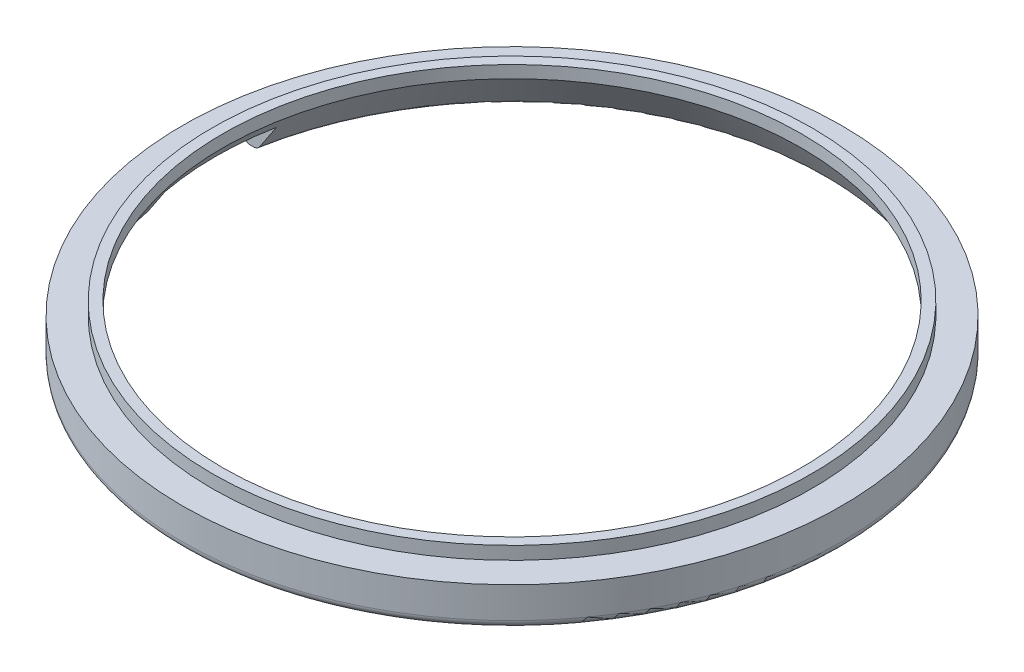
ISO-10303-21;
HEADER;
FILE_DESCRIPTION(('STEP AP214'),'2;1');
FILE_NAME('part.step','',(''),(''),'','','');
FILE_SCHEMA(('AUTOMOTIVE_DESIGN { 1 0 10303 214 1 1 1 1 }'));
ENDSEC;
DATA;
#1=APPLICATION_CONTEXT('core data for automotive mechanical design processes');
#2=APPLICATION_PROTOCOL_DEFINITION('international standard','automotive_design',2000,#1);
#3=PRODUCT_CONTEXT('',#1,'mechanical');
#4=PRODUCT('Part','Part','',(#3));
#5=PRODUCT_RELATED_PRODUCT_CATEGORY('part','',(#4));
#6=PRODUCT_DEFINITION_FORMATION('','',#4);
#7=PRODUCT_DEFINITION_CONTEXT('part definition',#1,'design');
#8=PRODUCT_DEFINITION('design','',#6,#7);
#9=PRODUCT_DEFINITION_SHAPE('','',#8);
#10=(LENGTH_UNIT() NAMED_UNIT(*) SI_UNIT(.MILLI.,.METRE.));
#11=(NAMED_UNIT(*) PLANE_ANGLE_UNIT() SI_UNIT($,.RADIAN.));
#12=(NAMED_UNIT(*) SI_UNIT($,.STERADIAN.) SOLID_ANGLE_UNIT());
#13=UNCERTAINTY_MEASURE_WITH_UNIT(LENGTH_MEASURE(1.E-05),#10,'distance_accuracy_value','');
#14=(GEOMETRIC_REPRESENTATION_CONTEXT(3) GLOBAL_UNCERTAINTY_ASSIGNED_CONTEXT((#13)) GLOBAL_UNIT_ASSIGNED_CONTEXT((#10,
#11,#12)) REPRESENTATION_CONTEXT('',''));
#15=CARTESIAN_POINT('',(0.,0.,0.));
#16=DIRECTION('',(0.,0.,1.));
#17=DIRECTION('',(1.,0.,0.));
#18=AXIS2_PLACEMENT_3D('',#15,#16,#17);
#19=CARTESIAN_POINT('',(0.,2.,0.));
#20=DIRECTION('',(0.,1.,0.));
#21=DIRECTION('',(0.,0.,1.));
#22=AXIS2_PLACEMENT_3D('',#19,#20,#21);
#23=PLANE('',#22);
#24=CARTESIAN_POINT('',(0.,2.,0.));
#25=DIRECTION('',(0.,1.,0.));
#26=DIRECTION('',(0.,0.,1.));
#27=AXIS2_PLACEMENT_3D('',#24,#25,#26);
#28=CIRCLE('',#27,11.15);
#29=CARTESIAN_POINT('',(0.,2.,11.15));
#30=VERTEX_POINT('',#29);
#31=EDGE_CURVE('E121',#30,#30,#28,.T.);
#32=ORIENTED_EDGE('',*,*,#31,.F.);
#33=EDGE_LOOP('',(#32));
#34=FACE_BOUND('',#33,.T.);
#35=CARTESIAN_POINT('',(0.,2.,0.));
#36=DIRECTION('',(0.,1.,0.));
#37=DIRECTION('',(0.,0.,1.));
#38=AXIS2_PLACEMENT_3D('',#35,#36,#37);
#39=CIRCLE('',#38,11.55);
#40=CARTESIAN_POINT('',(0.,2.,11.55));
#41=VERTEX_POINT('',#40);
#42=EDGE_CURVE('E208',#41,#41,#39,.T.);
#43=ORIENTED_EDGE('',*,*,#42,.T.);
#44=EDGE_LOOP('',(#43));
#45=FACE_BOUND('',#44,.T.);
#46=ADVANCED_FACE('F34',(#34,#45),#23,.T.);
#47=CARTESIAN_POINT('',(0.,2.,0.));
#48=DIRECTION('',(0.,-1.,0.));
#49=DIRECTION('',(0.,0.,-1.));
#50=AXIS2_PLACEMENT_3D('',#47,#48,#49);
#51=CYLINDRICAL_SURFACE('',#50,12.7);
#52=CARTESIAN_POINT('',(0.,1.4,0.));
#53=DIRECTION('',(0.,1.,0.));
#54=DIRECTION('',(0.,0.,1.));
#55=AXIS2_PLACEMENT_3D('',#52,#53,#54);
#56=CIRCLE('',#55,12.7);
#57=CARTESIAN_POINT('',(-12.516688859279,1.4,-2.15));
#58=VERTEX_POINT('',#57);
#59=CARTESIAN_POINT('',(-12.516688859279,1.4,2.15));
#60=VERTEX_POINT('',#59);
#61=EDGE_CURVE('E124',#58,#60,#56,.T.);
#62=ORIENTED_EDGE('',*,*,#61,.T.);
#63=DIRECTION('',(0.,-1.,0.));
#64=VECTOR('',#63,1.);
#65=CARTESIAN_POINT('',(-12.516688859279,2.,2.15));
#66=LINE('',#65,#64);
#67=CARTESIAN_POINT('',(-12.516688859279,0.3,2.15));
#68=VERTEX_POINT('',#67);
#69=EDGE_CURVE('E231',#60,#68,#66,.T.);
#70=ORIENTED_EDGE('',*,*,#69,.T.);
#71=CARTESIAN_POINT('',(0.,0.3,0.));
#72=DIRECTION('',(0.,1.,0.));
#73=DIRECTION('',(0.,0.,1.));
#74=AXIS2_PLACEMENT_3D('',#71,#72,#73);
#75=CIRCLE('',#74,12.7);
#76=CARTESIAN_POINT('',(-12.516688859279,0.3,-2.15));
#77=VERTEX_POINT('',#76);
#78=EDGE_CURVE('E120',#68,#77,#75,.T.);
#79=ORIENTED_EDGE('',*,*,#78,.T.);
#80=DIRECTION('',(0.,-1.,0.));
#81=VECTOR('',#80,1.);
#82=CARTESIAN_POINT('',(-12.516688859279,2.,-2.15));
#83=LINE('',#82,#81);
#84=EDGE_CURVE('E127',#77,#58,#83,.F.);
#85=ORIENTED_EDGE('',*,*,#84,.T.);
#86=EDGE_LOOP('',(#62,#70,#79,#85));
#87=FACE_BOUND('',#86,.T.);
#88=CARTESIAN_POINT('',(0.,1.5,0.));
#89=DIRECTION('',(0.,1.,0.));
#90=DIRECTION('',(0.,0.,1.));
#91=AXIS2_PLACEMENT_3D('',#88,#89,#90);
#92=CIRCLE('',#91,12.7);
#93=CARTESIAN_POINT('',(0.,1.5,12.7));
#94=VERTEX_POINT('',#93);
#95=EDGE_CURVE('E39',#94,#94,#92,.T.);
#96=ORIENTED_EDGE('',*,*,#95,.F.);
#97=EDGE_LOOP('',(#96));
#98=FACE_BOUND('',#97,.T.);
#99=ADVANCED_FACE('F176',(#87,#98),#51,.T.);
#100=CARTESIAN_POINT('',(0.,0.,0.));
#101=DIRECTION('',(0.,1.,0.));
#102=DIRECTION('',(0.,0.,1.));
#103=AXIS2_PLACEMENT_3D('',#100,#101,#102);
#104=PLANE('',#103);
#105=DIRECTION('',(1.,0.,0.));
#106=VECTOR('',#105,1.);
#107=CARTESIAN_POINT('',(-12.7,0.,-2.15));
#108=LINE('',#107,#106);
#109=CARTESIAN_POINT('',(-12.212186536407,0.,-2.15));
#110=VERTEX_POINT('',#109);
#111=CARTESIAN_POINT('',(-12.1228641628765,0.,-2.15));
#112=VERTEX_POINT('',#111);
#113=EDGE_CURVE('E236',#110,#112,#108,.T.);
#114=ORIENTED_EDGE('',*,*,#113,.F.);
#115=CARTESIAN_POINT('',(0.,0.,0.));
#116=DIRECTION('',(0.,1.,0.));
#117=DIRECTION('',(0.,0.,1.));
#118=AXIS2_PLACEMENT_3D('',#115,#116,#117);
#119=CIRCLE('',#118,12.4);
#120=CARTESIAN_POINT('',(-12.212186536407,0.,2.15));
#121=VERTEX_POINT('',#120);
#122=EDGE_CURVE('E242',#110,#121,#119,.F.);
#123=ORIENTED_EDGE('',*,*,#122,.T.);
#124=DIRECTION('',(1.,0.,0.));
#125=VECTOR('',#124,1.);
#126=CARTESIAN_POINT('',(-12.7,0.,2.15));
#127=LINE('',#126,#125);
#128=CARTESIAN_POINT('',(-12.1228641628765,0.,2.15));
#129=VERTEX_POINT('',#128);
#130=EDGE_CURVE('E234',#121,#129,#127,.T.);
#131=ORIENTED_EDGE('',*,*,#130,.T.);
#132=CARTESIAN_POINT('',(0.,0.,0.));
#133=DIRECTION('',(0.,1.,0.));
#134=DIRECTION('',(0.,0.,1.));
#135=AXIS2_PLACEMENT_3D('',#132,#133,#134);
#136=CIRCLE('',#135,12.312040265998);
#137=EDGE_CURVE('E241',#129,#112,#136,.T.);
#138=ORIENTED_EDGE('',*,*,#137,.T.);
#139=EDGE_LOOP('',(#114,#123,#131,#138));
#140=FACE_BOUND('',#139,.T.);
#141=ADVANCED_FACE('F221',(#140),#104,.F.);
#142=CARTESIAN_POINT('',(0.,2.,0.));
#143=DIRECTION('',(0.,-1.,0.));
#144=DIRECTION('',(0.,0.,-1.));
#145=AXIS2_PLACEMENT_3D('',#142,#143,#144);
#146=CYLINDRICAL_SURFACE('',#145,11.15);
#147=CARTESIAN_POINT('',(0.,1.52525347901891,0.));
#148=DIRECTION('',(0.,-1.,0.));
#149=DIRECTION('',(0.,0.,-1.));
#150=AXIS2_PLACEMENT_3D('',#147,#148,#149);
#151=CIRCLE('',#150,11.15);
#152=CARTESIAN_POINT('',(0.,1.52525347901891,-11.15));
#153=VERTEX_POINT('',#152);
#154=EDGE_CURVE('E205',#153,#153,#151,.T.);
#155=ORIENTED_EDGE('',*,*,#154,.T.);
#156=EDGE_LOOP('',(#155));
#157=FACE_BOUND('',#156,.T.);
#158=ORIENTED_EDGE('',*,*,#31,.T.);
#159=EDGE_LOOP('',(#158));
#160=FACE_BOUND('',#159,.T.);
#161=ADVANCED_FACE('F149',(#157,#160),#146,.F.);
#162=CARTESIAN_POINT('',(-12.7,0.,-2.15));
#163=DIRECTION('',(0.,0.,-1.));
#164=DIRECTION('',(0.,1.,0.));
#165=AXIS2_PLACEMENT_3D('',#162,#163,#164);
#166=PLANE('',#165);
#167=ORIENTED_EDGE('',*,*,#84,.F.);
#168=CARTESIAN_POINT('',(-12.516688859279,0.3,-2.15));
#169=CARTESIAN_POINT('',(-12.516704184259,0.283300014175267,-2.15));
#170=CARTESIAN_POINT('',(-12.51527494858,0.266605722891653,-2.15));
#171=CARTESIAN_POINT('',(-12.5096421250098,0.233711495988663,-2.15));
#172=CARTESIAN_POINT('',(-12.5054418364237,0.217510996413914,-2.15));
#173=CARTESIAN_POINT('',(-12.4943792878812,0.186040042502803,-2.15));
#174=CARTESIAN_POINT('',(-12.4875161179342,0.170769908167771,-2.15));
#175=CARTESIAN_POINT('',(-12.4713406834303,0.141589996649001,-2.15));
#176=CARTESIAN_POINT('',(-12.4620285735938,0.127680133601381,-2.15));
#177=CARTESIAN_POINT('',(-12.4411637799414,0.101515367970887,-2.15));
#178=CARTESIAN_POINT('',(-12.4295975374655,0.0892712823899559,-2.15));
#179=CARTESIAN_POINT('',(-12.4045962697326,0.0668646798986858,-2.15));
#180=CARTESIAN_POINT('',(-12.3911608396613,0.0567026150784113,-2.15));
#181=CARTESIAN_POINT('',(-12.3626072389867,0.0386007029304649,-2.15));
#182=CARTESIAN_POINT('',(-12.3474683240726,0.0306936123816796,-2.15));
#183=CARTESIAN_POINT('',(-12.3160921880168,0.0174974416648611,-2.15));
#184=CARTESIAN_POINT('',(-12.2998553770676,0.0122073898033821,-2.15));
#185=CARTESIAN_POINT('',(-12.2716532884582,0.00553607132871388,-2.15));
#186=CARTESIAN_POINT('',(-12.2598470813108,0.00346117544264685,-2.15));
#187=CARTESIAN_POINT('',(-12.2360908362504,0.000693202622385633,-2.15));
#188=CARTESIAN_POINT('',(-12.224141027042,-1.83742113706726E-06,-2.15));
#189=CARTESIAN_POINT('',(-12.212186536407,0.,-2.15));
#190=B_SPLINE_CURVE_WITH_KNOTS('',3,(#168,#169,#170,#171,#172,#173,#174,#175,#176,#177,#178,
#179,#180,#181,#182,#183,#184,#185,#186,#187,#188,#189),.UNSPECIFIED.,.F.,.F.,(4,2,2,2,2,2,2,2,
2,2,4),(0.,0.0500304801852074,0.10000149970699,0.149989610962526,0.199974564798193,
0.250270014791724,0.300576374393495,0.351580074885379,0.402564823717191,0.438450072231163,
0.474284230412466),.UNSPECIFIED.);
#191=EDGE_CURVE('E139',#77,#110,#190,.T.);
#192=ORIENTED_EDGE('',*,*,#191,.T.);
#193=ORIENTED_EDGE('',*,*,#113,.T.);
#194=CARTESIAN_POINT('',(-12.1228641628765,0.,-2.15));
#195=CARTESIAN_POINT('',(-12.1055158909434,-1.3442783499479E-05,-2.15));
#196=CARTESIAN_POINT('',(-12.0881703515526,0.00145816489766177,-2.15));
#197=CARTESIAN_POINT('',(-12.0539781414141,0.0072722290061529,-2.15));
#198=CARTESIAN_POINT('',(-12.0371311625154,0.0116128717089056,-2.15));
#199=CARTESIAN_POINT('',(-12.0043912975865,0.0230712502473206,-2.15));
#200=CARTESIAN_POINT('',(-11.9884993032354,0.0301915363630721,-2.15));
#201=CARTESIAN_POINT('',(-11.9581547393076,0.0470129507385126,-2.15));
#202=CARTESIAN_POINT('',(-11.9437013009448,0.056712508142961,-2.15));
#203=CARTESIAN_POINT('',(-11.9181712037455,0.0772170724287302,-2.15));
#204=CARTESIAN_POINT('',(-11.9068977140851,0.0877780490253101,-2.15));
#205=CARTESIAN_POINT('',(-11.8860743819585,0.110503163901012,-2.15));
#206=CARTESIAN_POINT('',(-11.8765266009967,0.122669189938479,-2.15));
#207=CARTESIAN_POINT('',(-11.8679798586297,0.135512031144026,-2.15));
#208=B_SPLINE_CURVE_WITH_KNOTS('',3,(#194,#195,#196,#197,#198,#199,#200,#201,#202,#203,#204,
#205,#206,#207),.UNSPECIFIED.,.F.,.F.,(4,2,2,2,2,2,4),(0.,0.051979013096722,0.103925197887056,
0.155919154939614,0.207881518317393,0.25404713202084,0.300267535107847),.UNSPECIFIED.);
#209=CARTESIAN_POINT('',(-11.8679798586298,0.13551203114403,-2.15));
#210=VERTEX_POINT('',#209);
#211=EDGE_CURVE('E104',#112,#210,#208,.T.);
#212=ORIENTED_EDGE('',*,*,#211,.T.);
#213=CARTESIAN_POINT('',(-13.5695185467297,-2.42330652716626,-2.15));
#214=CARTESIAN_POINT('',(-13.2928045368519,-2.00645330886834,-2.15));
#215=CARTESIAN_POINT('',(-13.0159518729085,-1.58969205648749,-2.15));
#216=CARTESIAN_POINT('',(-12.4618982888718,-0.756401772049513,-2.15));
#217=CARTESIAN_POINT('',(-12.1846973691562,-0.339872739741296,-2.15));
#218=CARTESIAN_POINT('',(-11.6298756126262,0.492905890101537,-2.15));
#219=CARTESIAN_POINT('',(-11.3522547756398,0.909155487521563,-2.15));
#220=CARTESIAN_POINT('',(-10.7964844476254,1.74130222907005,-2.15));
#221=CARTESIAN_POINT('',(-10.5183349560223,2.15719937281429,-2.15));
#222=CARTESIAN_POINT('',(-10.2398670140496,2.57288341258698,-2.15));
#223=B_SPLINE_CURVE_WITH_KNOTS('',3,(#213,#214,#215,#216,#217,#218,#219,#220,#221,#222),
.UNSPECIFIED.,.F.,.F.,(4,2,2,2,4),(0.,1.50101146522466,3.00202130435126,4.50303175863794,
6.00404384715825),.UNSPECIFIED.);
#224=CARTESIAN_POINT('',(-11.2247566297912,1.1,-2.15));
#225=VERTEX_POINT('',#224);
#226=EDGE_CURVE('E96',#210,#225,#223,.T.);
#227=ORIENTED_EDGE('',*,*,#226,.T.);
#228=DIRECTION('',(1.,0.,0.));
#229=VECTOR('',#228,1.);
#230=CARTESIAN_POINT('',(-12.7,1.1,-2.15));
#231=LINE('',#230,#229);
#232=CARTESIAN_POINT('',(-12.212186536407,1.1,-2.15));
#233=VERTEX_POINT('',#232);
#234=EDGE_CURVE('E100',#233,#225,#231,.T.);
#235=ORIENTED_EDGE('',*,*,#234,.F.);
#236=CARTESIAN_POINT('',(-12.212186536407,1.1,-2.15));
#237=CARTESIAN_POINT('',(-12.2295086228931,1.09998650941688,-2.15));
#238=CARTESIAN_POINT('',(-12.2468281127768,1.10145441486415,-2.15));
#239=CARTESIAN_POINT('',(-12.2809746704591,1.10725666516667,-2.15));
#240=CARTESIAN_POINT('',(-12.2978018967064,1.11159007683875,-2.15));
#241=CARTESIAN_POINT('',(-12.3304991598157,1.12303079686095,-2.15));
#242=CARTESIAN_POINT('',(-12.3463685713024,1.1301398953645,-2.15));
#243=CARTESIAN_POINT('',(-12.3766724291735,1.14693780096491,-2.15));
#244=CARTESIAN_POINT('',(-12.3911073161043,1.15662581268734,-2.15));
#245=CARTESIAN_POINT('',(-12.4180177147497,1.17824052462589,-2.15));
#246=CARTESIAN_POINT('',(-12.4305067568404,1.19015037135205,-2.15));
#247=CARTESIAN_POINT('',(-12.4532757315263,1.21592791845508,-2.15));
#248=CARTESIAN_POINT('',(-12.4635552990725,1.22979594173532,-2.15));
#249=CARTESIAN_POINT('',(-12.4814553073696,1.25888345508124,-2.15));
#250=CARTESIAN_POINT('',(-12.4891109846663,1.27408128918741,-2.15));
#251=CARTESIAN_POINT('',(-12.5017191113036,1.30555394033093,-2.15));
#252=CARTESIAN_POINT('',(-12.5066737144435,1.32182788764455,-2.15));
#253=CARTESIAN_POINT('',(-12.5123578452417,1.34851963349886,-2.15));
#254=CARTESIAN_POINT('',(-12.5139810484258,1.35875550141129,-2.15));
#255=CARTESIAN_POINT('',(-12.5161462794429,1.37932600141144,-2.15));
#256=CARTESIAN_POINT('',(-12.5166898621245,1.38966046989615,-2.15));
#257=CARTESIAN_POINT('',(-12.5166888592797,1.39999999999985,-2.15));
#258=B_SPLINE_CURVE_WITH_KNOTS('',3,(#236,#237,#238,#239,#240,#241,#242,#243,#244,#245,#246,
#247,#248,#249,#250,#251,#252,#253,#254,#255,#256,#257),.UNSPECIFIED.,.F.,.F.,(4,2,2,2,2,2,2,2,
2,2,4),(0.,0.0519007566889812,0.103784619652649,0.155702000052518,0.207603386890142,
0.259126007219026,0.31065713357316,0.361466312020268,0.412234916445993,0.443274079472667,
0.47426850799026),.UNSPECIFIED.);
#259=EDGE_CURVE('E12',#233,#58,#258,.T.);
#260=ORIENTED_EDGE('',*,*,#259,.T.);
#261=EDGE_LOOP('',(#167,#192,#193,#212,#227,#235,#260));
#262=FACE_BOUND('',#261,.T.);
#263=ADVANCED_FACE('F99',(#262),#166,.F.);
#264=CARTESIAN_POINT('',(-12.7,0.,2.15));
#265=DIRECTION('',(0.,0.,1.));
#266=DIRECTION('',(0.,-1.,0.));
#267=AXIS2_PLACEMENT_3D('',#264,#265,#266);
#268=PLANE('',#267);
#269=ORIENTED_EDGE('',*,*,#130,.F.);
#270=CARTESIAN_POINT('',(-12.212186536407,0.,2.15));
#271=CARTESIAN_POINT('',(-12.2295086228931,-1.3490583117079E-05,2.15));
#272=CARTESIAN_POINT('',(-12.2468281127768,0.00145441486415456,2.15));
#273=CARTESIAN_POINT('',(-12.2809746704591,0.00725666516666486,2.15));
#274=CARTESIAN_POINT('',(-12.2978018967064,0.0115900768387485,2.15));
#275=CARTESIAN_POINT('',(-12.3304991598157,0.0230307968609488,2.15));
#276=CARTESIAN_POINT('',(-12.3463685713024,0.0301398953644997,2.15));
#277=CARTESIAN_POINT('',(-12.3766724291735,0.0469378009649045,2.15));
#278=CARTESIAN_POINT('',(-12.3911073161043,0.0566258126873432,2.15));
#279=CARTESIAN_POINT('',(-12.4180177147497,0.0782405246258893,2.15));
#280=CARTESIAN_POINT('',(-12.4305067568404,0.0901503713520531,2.15));
#281=CARTESIAN_POINT('',(-12.4532757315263,0.115927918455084,2.15));
#282=CARTESIAN_POINT('',(-12.4635552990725,0.129795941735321,2.15));
#283=CARTESIAN_POINT('',(-12.4814553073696,0.158883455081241,2.15));
#284=CARTESIAN_POINT('',(-12.4891109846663,0.174081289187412,2.15));
#285=CARTESIAN_POINT('',(-12.5017191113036,0.205553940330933,2.15));
#286=CARTESIAN_POINT('',(-12.5066737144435,0.221827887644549,2.15));
#287=CARTESIAN_POINT('',(-12.5123578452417,0.24851963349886,2.15));
#288=CARTESIAN_POINT('',(-12.5139810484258,0.258755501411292,2.15));
#289=CARTESIAN_POINT('',(-12.5161462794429,0.279326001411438,2.15));
#290=CARTESIAN_POINT('',(-12.5166898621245,0.289660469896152,2.15));
#291=CARTESIAN_POINT('',(-12.5166888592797,0.299999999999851,2.15));
#292=B_SPLINE_CURVE_WITH_KNOTS('',3,(#270,#271,#272,#273,#274,#275,#276,#277,#278,#279,#280,
#281,#282,#283,#284,#285,#286,#287,#288,#289,#290,#291),.UNSPECIFIED.,.F.,.F.,(4,2,2,2,2,2,2,2,
2,2,4),(0.,0.0519007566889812,0.103784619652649,0.155702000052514,0.207603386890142,
0.259126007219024,0.31065713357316,0.361466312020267,0.412234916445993,0.443274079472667,
0.47426850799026),.UNSPECIFIED.);
#293=EDGE_CURVE('E184',#121,#68,#292,.T.);
#294=ORIENTED_EDGE('',*,*,#293,.T.);
#295=ORIENTED_EDGE('',*,*,#69,.F.);
#296=CARTESIAN_POINT('',(-12.516688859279,1.4,2.15));
#297=CARTESIAN_POINT('',(-12.516704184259,1.38330001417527,2.15));
#298=CARTESIAN_POINT('',(-12.51527494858,1.36660572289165,2.15));
#299=CARTESIAN_POINT('',(-12.5096421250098,1.33371149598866,2.15));
#300=CARTESIAN_POINT('',(-12.5054418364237,1.31751099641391,2.15));
#301=CARTESIAN_POINT('',(-12.4943792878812,1.2860400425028,2.15));
#302=CARTESIAN_POINT('',(-12.4875161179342,1.27076990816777,2.15));
#303=CARTESIAN_POINT('',(-12.4713406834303,1.241589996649,2.15));
#304=CARTESIAN_POINT('',(-12.4620285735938,1.22768013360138,2.15));
#305=CARTESIAN_POINT('',(-12.4411637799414,1.20151536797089,2.15));
#306=CARTESIAN_POINT('',(-12.4295975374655,1.18927128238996,2.15));
#307=CARTESIAN_POINT('',(-12.4045962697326,1.16686467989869,2.15));
#308=CARTESIAN_POINT('',(-12.3911608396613,1.15670261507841,2.15));
#309=CARTESIAN_POINT('',(-12.3626072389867,1.13860070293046,2.15));
#310=CARTESIAN_POINT('',(-12.3474683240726,1.13069361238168,2.15));
#311=CARTESIAN_POINT('',(-12.3160921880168,1.11749744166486,2.15));
#312=CARTESIAN_POINT('',(-12.2998553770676,1.11220738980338,2.15));
#313=CARTESIAN_POINT('',(-12.2716532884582,1.10553607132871,2.15));
#314=CARTESIAN_POINT('',(-12.2598470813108,1.10346117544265,2.15));
#315=CARTESIAN_POINT('',(-12.2360908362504,1.10069320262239,2.15));
#316=CARTESIAN_POINT('',(-12.224141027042,1.09999816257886,2.15));
#317=CARTESIAN_POINT('',(-12.212186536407,1.1,2.15));
#318=B_SPLINE_CURVE_WITH_KNOTS('',3,(#296,#297,#298,#299,#300,#301,#302,#303,#304,#305,#306,
#307,#308,#309,#310,#311,#312,#313,#314,#315,#316,#317),.UNSPECIFIED.,.F.,.F.,(4,2,2,2,2,2,2,2,
2,2,4),(0.,0.050030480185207,0.100001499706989,0.149989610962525,0.199974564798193,
0.250270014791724,0.300576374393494,0.351580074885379,0.402564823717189,0.438450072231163,
0.474284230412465),.UNSPECIFIED.);
#319=CARTESIAN_POINT('',(-12.212186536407,1.1,2.15));
#320=VERTEX_POINT('',#319);
#321=EDGE_CURVE('E44',#60,#320,#318,.T.);
#322=ORIENTED_EDGE('',*,*,#321,.T.);
#323=DIRECTION('',(1.,0.,0.));
#324=VECTOR('',#323,1.);
#325=CARTESIAN_POINT('',(-12.7,1.1,2.15));
#326=LINE('',#325,#324);
#327=CARTESIAN_POINT('',(-11.2247566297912,1.1,2.15));
#328=VERTEX_POINT('',#327);
#329=EDGE_CURVE('E116',#320,#328,#326,.T.);
#330=ORIENTED_EDGE('',*,*,#329,.T.);
#331=CARTESIAN_POINT('',(-10.2398670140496,2.57288341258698,2.15));
#332=CARTESIAN_POINT('',(-10.5183349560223,2.15719937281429,2.15));
#333=CARTESIAN_POINT('',(-10.7964844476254,1.74130222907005,2.15));
#334=CARTESIAN_POINT('',(-11.3522547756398,0.909155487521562,2.15));
#335=CARTESIAN_POINT('',(-11.6298756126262,0.492905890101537,2.15));
#336=CARTESIAN_POINT('',(-12.1846973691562,-0.339872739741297,2.15));
#337=CARTESIAN_POINT('',(-12.4618982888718,-0.756401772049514,2.15));
#338=CARTESIAN_POINT('',(-13.0159518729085,-1.5896920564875,2.15));
#339=CARTESIAN_POINT('',(-13.2928045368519,-2.00645330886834,2.15));
#340=CARTESIAN_POINT('',(-13.5695185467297,-2.42330652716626,2.15));
#341=B_SPLINE_CURVE_WITH_KNOTS('',3,(#331,#332,#333,#334,#335,#336,#337,#338,#339,#340),
.UNSPECIFIED.,.F.,.F.,(4,2,2,2,4),(0.,1.50101208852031,3.00202254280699,4.50303238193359,
6.00404384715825),.UNSPECIFIED.);
#342=CARTESIAN_POINT('',(-11.8679798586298,0.135512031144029,2.15));
#343=VERTEX_POINT('',#342);
#344=EDGE_CURVE('E107',#328,#343,#341,.T.);
#345=ORIENTED_EDGE('',*,*,#344,.T.);
#346=CARTESIAN_POINT('',(-11.8679798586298,0.135512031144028,2.15000000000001));
#347=CARTESIAN_POINT('',(-11.8774356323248,0.121294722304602,2.15));
#348=CARTESIAN_POINT('',(-11.8881241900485,0.107909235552,2.15));
#349=CARTESIAN_POINT('',(-11.9115747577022,0.0831475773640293,2.15));
#350=CARTESIAN_POINT('',(-11.9243325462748,0.0717674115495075,2.15));
#351=CARTESIAN_POINT('',(-11.9515753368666,0.0512985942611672,2.15));
#352=CARTESIAN_POINT('',(-11.9660609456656,0.0422107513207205,2.15));
#353=CARTESIAN_POINT('',(-11.9963415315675,0.0265620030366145,2.15));
#354=CARTESIAN_POINT('',(-12.0121367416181,0.0200015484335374,2.15));
#355=CARTESIAN_POINT('',(-12.0436011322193,0.00989858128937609,2.15));
#356=CARTESIAN_POINT('',(-12.0592194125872,0.00619661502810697,2.15));
#357=CARTESIAN_POINT('',(-12.0908452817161,0.00124232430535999,2.15));
#358=CARTESIAN_POINT('',(-12.1068530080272,-9.12154720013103E-06,2.15));
#359=CARTESIAN_POINT('',(-12.1228641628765,0.,2.15));
#360=B_SPLINE_CURVE_WITH_KNOTS('',3,(#346,#347,#348,#349,#350,#351,#352,#353,#354,#355,#356,
#357,#358,#359),.UNSPECIFIED.,.F.,.F.,(4,2,2,2,2,2,4),(0.,0.0511479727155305,0.102192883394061,
0.153255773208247,0.20432776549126,0.252289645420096,0.300268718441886),.UNSPECIFIED.);
#361=EDGE_CURVE('E51',#343,#129,#360,.T.);
#362=ORIENTED_EDGE('',*,*,#361,.T.);
#363=EDGE_LOOP('',(#269,#294,#295,#322,#330,#345,#362));
#364=FACE_BOUND('',#363,.T.);
#365=ADVANCED_FACE('F148',(#364),#268,.F.);
#366=CARTESIAN_POINT('',(-12.7,1.1,-2.15));
#367=DIRECTION('',(0.,1.,0.));
#368=DIRECTION('',(0.,0.,1.));
#369=AXIS2_PLACEMENT_3D('',#366,#367,#368);
#370=PLANE('',#369);
#371=ORIENTED_EDGE('',*,*,#329,.F.);
#372=CARTESIAN_POINT('',(0.,1.1,0.));
#373=DIRECTION('',(0.,1.,0.));
#374=DIRECTION('',(0.,0.,1.));
#375=AXIS2_PLACEMENT_3D('',#372,#373,#374);
#376=CIRCLE('',#375,12.4);
#377=EDGE_CURVE('E115',#320,#233,#376,.F.);
#378=ORIENTED_EDGE('',*,*,#377,.T.);
#379=ORIENTED_EDGE('',*,*,#234,.T.);
#380=CARTESIAN_POINT('',(0.,1.1,0.));
#381=DIRECTION('',(0.,1.,0.));
#382=DIRECTION('',(0.,0.,1.));
#383=AXIS2_PLACEMENT_3D('',#380,#381,#382);
#384=CIRCLE('',#383,11.4288083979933);
#385=EDGE_CURVE('E113',#225,#328,#384,.T.);
#386=ORIENTED_EDGE('',*,*,#385,.T.);
#387=EDGE_LOOP('',(#371,#378,#379,#386));
#388=FACE_BOUND('',#387,.T.);
#389=ADVANCED_FACE('F112',(#388),#370,.F.);
#390=CARTESIAN_POINT('',(0.,0.,0.));
#391=DIRECTION('',(0.,-1.,0.));
#392=DIRECTION('',(0.,0.,-1.));
#393=AXIS2_PLACEMENT_3D('',#390,#391,#392);
#394=CONICAL_SURFACE('',#393,12.15,0.580321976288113);
#395=ORIENTED_EDGE('',*,*,#154,.F.);
#396=EDGE_LOOP('',(#395));
#397=FACE_BOUND('',#396,.T.);
#398=ORIENTED_EDGE('',*,*,#226,.F.);
#399=CARTESIAN_POINT('',(0.,0.135512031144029,0.));
#400=DIRECTION('',(0.,1.,0.));
#401=DIRECTION('',(0.,0.,1.));
#402=AXIS2_PLACEMENT_3D('',#399,#400,#401);
#403=CIRCLE('',#402,12.0611544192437);
#404=EDGE_CURVE('E189',#210,#343,#403,.F.);
#405=ORIENTED_EDGE('',*,*,#404,.T.);
#406=ORIENTED_EDGE('',*,*,#344,.F.);
#407=ORIENTED_EDGE('',*,*,#385,.F.);
#408=EDGE_LOOP('',(#398,#405,#406,#407));
#409=FACE_BOUND('',#408,.T.);
#410=ADVANCED_FACE('F119',(#397,#409),#394,.F.);
#411=CARTESIAN_POINT('',(0.,1.4,0.));
#412=DIRECTION('',(0.,1.,0.));
#413=DIRECTION('',(0.,0.,1.));
#414=AXIS2_PLACEMENT_3D('',#411,#412,#413);
#415=TOROIDAL_SURFACE('',#414,12.4,0.3);
#416=ORIENTED_EDGE('',*,*,#259,.F.);
#417=ORIENTED_EDGE('',*,*,#377,.F.);
#418=ORIENTED_EDGE('',*,*,#321,.F.);
#419=ORIENTED_EDGE('',*,*,#61,.F.);
#420=EDGE_LOOP('',(#416,#417,#418,#419));
#421=FACE_BOUND('',#420,.T.);
#422=ADVANCED_FACE('F170',(#421),#415,.T.);
#423=CARTESIAN_POINT('',(0.,0.3,0.));
#424=DIRECTION('',(0.,1.,0.));
#425=DIRECTION('',(0.,0.,1.));
#426=AXIS2_PLACEMENT_3D('',#423,#424,#425);
#427=TOROIDAL_SURFACE('',#426,12.4,0.3);
#428=ORIENTED_EDGE('',*,*,#293,.F.);
#429=ORIENTED_EDGE('',*,*,#122,.F.);
#430=ORIENTED_EDGE('',*,*,#191,.F.);
#431=ORIENTED_EDGE('',*,*,#78,.F.);
#432=EDGE_LOOP('',(#428,#429,#430,#431));
#433=FACE_BOUND('',#432,.T.);
#434=ADVANCED_FACE('F174',(#433),#427,.T.);
#435=CARTESIAN_POINT('',(0.,0.3,0.));
#436=DIRECTION('',(0.,1.,0.));
#437=DIRECTION('',(0.,0.,1.));
#438=AXIS2_PLACEMENT_3D('',#435,#436,#437);
#439=TOROIDAL_SURFACE('',#438,12.312040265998,0.3);
#440=ORIENTED_EDGE('',*,*,#211,.F.);
#441=ORIENTED_EDGE('',*,*,#137,.F.);
#442=ORIENTED_EDGE('',*,*,#361,.F.);
#443=ORIENTED_EDGE('',*,*,#404,.F.);
#444=EDGE_LOOP('',(#440,#441,#442,#443));
#445=FACE_BOUND('',#444,.T.);
#446=ADVANCED_FACE('F36',(#445),#439,.T.);
#447=CARTESIAN_POINT('',(0.,1.5,0.));
#448=DIRECTION('',(0.,1.,0.));
#449=DIRECTION('',(0.,0.,1.));
#450=AXIS2_PLACEMENT_3D('',#447,#448,#449);
#451=PLANE('',#450);
#452=CARTESIAN_POINT('',(0.,1.5,0.));
#453=DIRECTION('',(0.,1.,0.));
#454=DIRECTION('',(0.,0.,1.));
#455=AXIS2_PLACEMENT_3D('',#452,#453,#454);
#456=CIRCLE('',#455,11.55);
#457=CARTESIAN_POINT('',(0.,1.5,11.55));
#458=VERTEX_POINT('',#457);
#459=EDGE_CURVE('E211',#458,#458,#456,.T.);
#460=ORIENTED_EDGE('',*,*,#459,.F.);
#461=EDGE_LOOP('',(#460));
#462=FACE_BOUND('',#461,.T.);
#463=ORIENTED_EDGE('',*,*,#95,.T.);
#464=EDGE_LOOP('',(#463));
#465=FACE_BOUND('',#464,.T.);
#466=ADVANCED_FACE('F218',(#462,#465),#451,.T.);
#467=CARTESIAN_POINT('',(0.,1.5,0.));
#468=DIRECTION('',(0.,1.,0.));
#469=DIRECTION('',(0.,0.,1.));
#470=AXIS2_PLACEMENT_3D('',#467,#468,#469);
#471=CYLINDRICAL_SURFACE('',#470,11.55);
#472=ORIENTED_EDGE('',*,*,#459,.T.);
#473=EDGE_LOOP('',(#472));
#474=FACE_BOUND('',#473,.T.);
#475=ORIENTED_EDGE('',*,*,#42,.F.);
#476=EDGE_LOOP('',(#475));
#477=FACE_BOUND('',#476,.T.);
#478=ADVANCED_FACE('F248',(#474,#477),#471,.T.);
#479=CLOSED_SHELL('',(#46,#99,#141,#161,#263,#365,#389,#410,#422,#434,#446,#466,#478));
#480=MANIFOLD_SOLID_BREP('B2',#479);
#481=ADVANCED_BREP_SHAPE_REPRESENTATION('',(#18,#480),#14);
#482=SHAPE_DEFINITION_REPRESENTATION(#9,#481);
ENDSEC;
END-ISO-10303-21;
